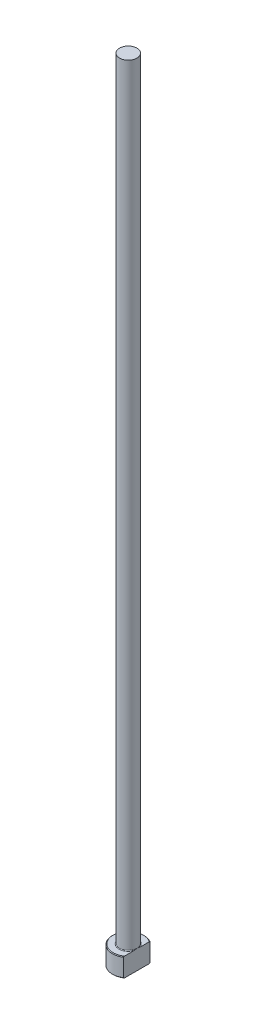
from build123d import *
from build123d.topology import SkipClean

# Parameters (mm, degrees)
CHAMFER1_SIZE    = 0.2
FILLET1_R        = 0.2
KEYED_HEAD_DEPTH = 251.099980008


with BuildPart() as part:
    # Sketch1 → Revolve1 (revolve)
    with BuildSketch(Plane.XY, mode=Mode.PRIVATE) as revolve1_sk:
        Polygon((0, 0), (-5, 0), (-5, 6), (-2.75, 6), (-2.75, 250), (0, 250), align=None)
    revolve(revolve1_sk.sketch.rotate(Axis((0, 259.958771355, 0), (0, -1, 0)), 270), axis=Axis((0, 259.958771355, 0), (0, -1, 0)))

    # Chamfer1
    chamfer1_edges = [part.edges().sort_by_distance(p)[0] for p in [
        (0, 6, -5),
        (0, 0, -5),
    ]]
    chamfer(chamfer1_edges, length=CHAMFER1_SIZE)

    # Fillet1
    fillet1_edges = [part.edges().sort_by_distance(p)[0] for p in [
        (0, 6, -2.75),
    ]]
    fillet(fillet1_edges, radius=FILLET1_R)

    # Sketch2 → KEYED HEAD (cut, through all)
    with SkipClean():  # the faces are left unmerged after this step: merging them gives an invalid solid
        with BuildSketch(Plane(origin=(0, 0, 0), x_dir=(1, 0, 0), z_dir=(0, 1, 0))):
            with BuildLine():
                Line((2.75, -4.175823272), (2.75, 4.175823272))
                ThreePointArc((2.75, 4.175823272), (5, 0), (2.75, -4.175823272))
            make_face()
        extrude(amount=KEYED_HEAD_DEPTH, mode=Mode.SUBTRACT)


solid = part.part
